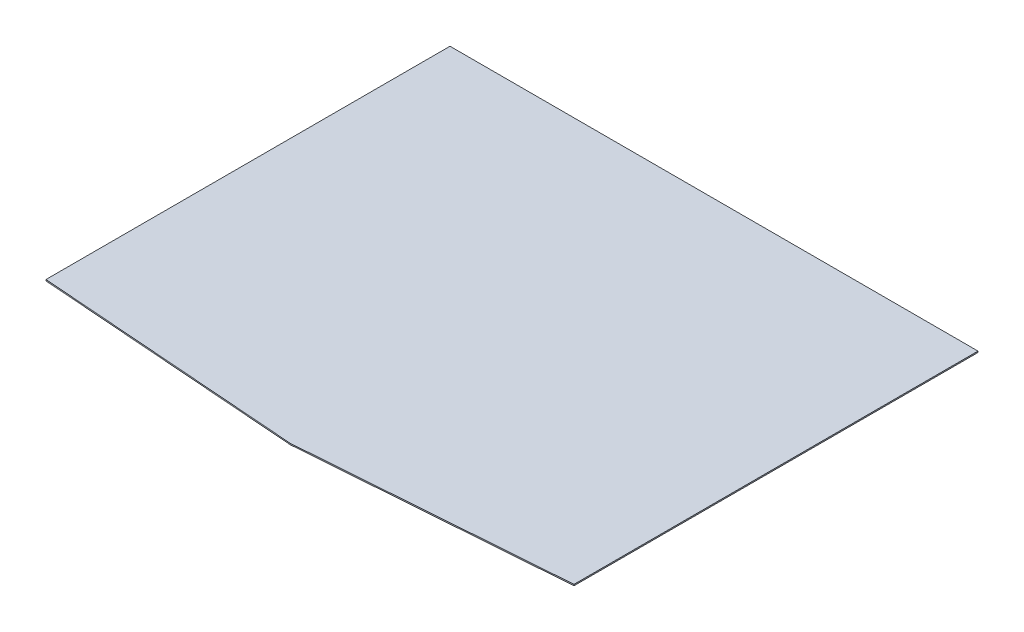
ISO-10303-21;
HEADER;
FILE_DESCRIPTION(('STEP AP214'),'2;1');
FILE_NAME('part.step','',(''),(''),'','','');
FILE_SCHEMA(('AUTOMOTIVE_DESIGN { 1 0 10303 214 1 1 1 1 }'));
ENDSEC;
DATA;
#1=APPLICATION_CONTEXT('core data for automotive mechanical design processes');
#2=APPLICATION_PROTOCOL_DEFINITION('international standard','automotive_design',2000,#1);
#3=PRODUCT_CONTEXT('',#1,'mechanical');
#4=PRODUCT('Part','Part','',(#3));
#5=PRODUCT_RELATED_PRODUCT_CATEGORY('part','',(#4));
#6=PRODUCT_DEFINITION_FORMATION('','',#4);
#7=PRODUCT_DEFINITION_CONTEXT('part definition',#1,'design');
#8=PRODUCT_DEFINITION('design','',#6,#7);
#9=PRODUCT_DEFINITION_SHAPE('','',#8);
#10=(LENGTH_UNIT() NAMED_UNIT(*) SI_UNIT(.MILLI.,.METRE.));
#11=(NAMED_UNIT(*) PLANE_ANGLE_UNIT() SI_UNIT($,.RADIAN.));
#12=(NAMED_UNIT(*) SI_UNIT($,.STERADIAN.) SOLID_ANGLE_UNIT());
#13=UNCERTAINTY_MEASURE_WITH_UNIT(LENGTH_MEASURE(1.E-05),#10,'distance_accuracy_value','');
#14=(GEOMETRIC_REPRESENTATION_CONTEXT(3) GLOBAL_UNCERTAINTY_ASSIGNED_CONTEXT((#13)) GLOBAL_UNIT_ASSIGNED_CONTEXT((#10,
#11,#12)) REPRESENTATION_CONTEXT('',''));
#15=CARTESIAN_POINT('',(0.,0.,0.));
#16=DIRECTION('',(0.,0.,1.));
#17=DIRECTION('',(1.,0.,0.));
#18=AXIS2_PLACEMENT_3D('',#15,#16,#17);
#19=CARTESIAN_POINT('',(0.,-4.7625,0.));
#20=DIRECTION('',(0.0746320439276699,0.,0.99721114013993));
#21=DIRECTION('',(0.99721114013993,0.,-0.0746320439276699));
#22=AXIS2_PLACEMENT_3D('',#19,#20,#21);
#23=PLANE('',#22);
#24=DIRECTION('',(0.99721114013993,0.,-0.0746320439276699));
#25=VECTOR('',#24,1.);
#26=CARTESIAN_POINT('',(0.,0.,0.));
#27=LINE('',#26,#25);
#28=CARTESIAN_POINT('',(0.,0.,0.));
#29=VERTEX_POINT('',#28);
#30=CARTESIAN_POINT('',(996.95,0.,-74.6125));
#31=VERTEX_POINT('',#30);
#32=EDGE_CURVE('E114',#29,#31,#27,.T.);
#33=ORIENTED_EDGE('',*,*,#32,.F.);
#34=DIRECTION('',(0.,1.,0.));
#35=VECTOR('',#34,1.);
#36=CARTESIAN_POINT('',(0.,-4.7625,0.));
#37=LINE('',#36,#35);
#38=CARTESIAN_POINT('',(0.,-4.7625,0.));
#39=VERTEX_POINT('',#38);
#40=EDGE_CURVE('E11',#39,#29,#37,.T.);
#41=ORIENTED_EDGE('',*,*,#40,.F.);
#42=DIRECTION('',(0.99721114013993,0.,-0.0746320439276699));
#43=VECTOR('',#42,1.);
#44=CARTESIAN_POINT('',(0.,-4.7625,0.));
#45=LINE('',#44,#43);
#46=CARTESIAN_POINT('',(996.95,-4.7625,-74.6125));
#47=VERTEX_POINT('',#46);
#48=EDGE_CURVE('E109',#39,#47,#45,.T.);
#49=ORIENTED_EDGE('',*,*,#48,.T.);
#50=DIRECTION('',(0.,1.,0.));
#51=VECTOR('',#50,1.);
#52=CARTESIAN_POINT('',(996.95,-4.7625,-74.6125));
#53=LINE('',#52,#51);
#54=EDGE_CURVE('E40',#47,#31,#53,.T.);
#55=ORIENTED_EDGE('',*,*,#54,.T.);
#56=EDGE_LOOP('',(#33,#41,#49,#55));
#57=FACE_BOUND('',#56,.T.);
#58=ADVANCED_FACE('F37',(#57),#23,.T.);
#59=CARTESIAN_POINT('',(0.,-4.7625,0.));
#60=DIRECTION('',(-0.0746320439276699,0.,0.99721114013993));
#61=DIRECTION('',(0.99721114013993,0.,0.0746320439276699));
#62=AXIS2_PLACEMENT_3D('',#59,#60,#61);
#63=PLANE('',#62);
#64=DIRECTION('',(0.99721114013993,0.,0.0746320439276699));
#65=VECTOR('',#64,1.);
#66=CARTESIAN_POINT('',(0.,0.,0.));
#67=LINE('',#66,#65);
#68=CARTESIAN_POINT('',(-996.95,0.,-74.6125));
#69=VERTEX_POINT('',#68);
#70=EDGE_CURVE('E123',#69,#29,#67,.T.);
#71=ORIENTED_EDGE('',*,*,#70,.F.);
#72=DIRECTION('',(0.,1.,0.));
#73=VECTOR('',#72,1.);
#74=CARTESIAN_POINT('',(-996.95,-4.7625,-74.6125));
#75=LINE('',#74,#73);
#76=CARTESIAN_POINT('',(-996.95,-4.7625,-74.6125));
#77=VERTEX_POINT('',#76);
#78=EDGE_CURVE('E46',#77,#69,#75,.T.);
#79=ORIENTED_EDGE('',*,*,#78,.F.);
#80=DIRECTION('',(0.99721114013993,0.,0.0746320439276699));
#81=VECTOR('',#80,1.);
#82=CARTESIAN_POINT('',(0.,-4.7625,0.));
#83=LINE('',#82,#81);
#84=EDGE_CURVE('E104',#77,#39,#83,.T.);
#85=ORIENTED_EDGE('',*,*,#84,.T.);
#86=ORIENTED_EDGE('',*,*,#40,.T.);
#87=EDGE_LOOP('',(#71,#79,#85,#86));
#88=FACE_BOUND('',#87,.T.);
#89=ADVANCED_FACE('F129',(#88),#63,.T.);
#90=CARTESIAN_POINT('',(-996.95,-4.7625,-1600.2));
#91=DIRECTION('',(-1.,0.,0.));
#92=DIRECTION('',(0.,0.,1.));
#93=AXIS2_PLACEMENT_3D('',#90,#91,#92);
#94=PLANE('',#93);
#95=DIRECTION('',(0.,0.,1.));
#96=VECTOR('',#95,1.);
#97=CARTESIAN_POINT('',(-996.95,0.,-1600.2));
#98=LINE('',#97,#96);
#99=CARTESIAN_POINT('',(-996.95,0.,-1600.2));
#100=VERTEX_POINT('',#99);
#101=EDGE_CURVE('E93',#100,#69,#98,.T.);
#102=ORIENTED_EDGE('',*,*,#101,.F.);
#103=DIRECTION('',(0.,1.,0.));
#104=VECTOR('',#103,1.);
#105=CARTESIAN_POINT('',(-996.95,-4.7625,-1600.2));
#106=LINE('',#105,#104);
#107=CARTESIAN_POINT('',(-996.95,-4.7625,-1600.2));
#108=VERTEX_POINT('',#107);
#109=EDGE_CURVE('E88',#108,#100,#106,.T.);
#110=ORIENTED_EDGE('',*,*,#109,.F.);
#111=DIRECTION('',(0.,0.,1.));
#112=VECTOR('',#111,1.);
#113=CARTESIAN_POINT('',(-996.95,-4.7625,-1600.2));
#114=LINE('',#113,#112);
#115=EDGE_CURVE('E91',#108,#77,#114,.T.);
#116=ORIENTED_EDGE('',*,*,#115,.T.);
#117=ORIENTED_EDGE('',*,*,#78,.T.);
#118=EDGE_LOOP('',(#102,#110,#116,#117));
#119=FACE_BOUND('',#118,.T.);
#120=ADVANCED_FACE('F90',(#119),#94,.T.);
#121=CARTESIAN_POINT('',(996.95,-4.7625,-1600.2));
#122=DIRECTION('',(0.,0.,-1.));
#123=DIRECTION('',(-1.,0.,0.));
#124=AXIS2_PLACEMENT_3D('',#121,#122,#123);
#125=PLANE('',#124);
#126=DIRECTION('',(-1.,0.,0.));
#127=VECTOR('',#126,1.);
#128=CARTESIAN_POINT('',(996.95,0.,-1600.2));
#129=LINE('',#128,#127);
#130=CARTESIAN_POINT('',(996.95,0.,-1600.2));
#131=VERTEX_POINT('',#130);
#132=EDGE_CURVE('E120',#131,#100,#129,.T.);
#133=ORIENTED_EDGE('',*,*,#132,.F.);
#134=DIRECTION('',(0.,1.,0.));
#135=VECTOR('',#134,1.);
#136=CARTESIAN_POINT('',(996.95,-4.7625,-1600.2));
#137=LINE('',#136,#135);
#138=CARTESIAN_POINT('',(996.95,-4.7625,-1600.2));
#139=VERTEX_POINT('',#138);
#140=EDGE_CURVE('E98',#139,#131,#137,.T.);
#141=ORIENTED_EDGE('',*,*,#140,.F.);
#142=DIRECTION('',(-1.,0.,0.));
#143=VECTOR('',#142,1.);
#144=CARTESIAN_POINT('',(996.95,-4.7625,-1600.2));
#145=LINE('',#144,#143);
#146=EDGE_CURVE('E103',#139,#108,#145,.T.);
#147=ORIENTED_EDGE('',*,*,#146,.T.);
#148=ORIENTED_EDGE('',*,*,#109,.T.);
#149=EDGE_LOOP('',(#133,#141,#147,#148));
#150=FACE_BOUND('',#149,.T.);
#151=ADVANCED_FACE('F106',(#150),#125,.T.);
#152=CARTESIAN_POINT('',(996.95,-4.7625,-74.6125));
#153=DIRECTION('',(1.,0.,0.));
#154=DIRECTION('',(0.,0.,-1.));
#155=AXIS2_PLACEMENT_3D('',#152,#153,#154);
#156=PLANE('',#155);
#157=DIRECTION('',(0.,0.,-1.));
#158=VECTOR('',#157,1.);
#159=CARTESIAN_POINT('',(996.95,0.,-74.6125));
#160=LINE('',#159,#158);
#161=EDGE_CURVE('E117',#31,#131,#160,.T.);
#162=ORIENTED_EDGE('',*,*,#161,.F.);
#163=ORIENTED_EDGE('',*,*,#54,.F.);
#164=DIRECTION('',(0.,0.,-1.));
#165=VECTOR('',#164,1.);
#166=CARTESIAN_POINT('',(996.95,-4.7625,-74.6125));
#167=LINE('',#166,#165);
#168=EDGE_CURVE('E107',#47,#139,#167,.T.);
#169=ORIENTED_EDGE('',*,*,#168,.T.);
#170=ORIENTED_EDGE('',*,*,#140,.T.);
#171=EDGE_LOOP('',(#162,#163,#169,#170));
#172=FACE_BOUND('',#171,.T.);
#173=ADVANCED_FACE('F126',(#172),#156,.T.);
#174=CARTESIAN_POINT('',(996.95,-4.7625,-74.6125));
#175=DIRECTION('',(0.,1.,0.));
#176=DIRECTION('',(0.,0.,1.));
#177=AXIS2_PLACEMENT_3D('',#174,#175,#176);
#178=PLANE('',#177);
#179=ORIENTED_EDGE('',*,*,#48,.F.);
#180=ORIENTED_EDGE('',*,*,#84,.F.);
#181=ORIENTED_EDGE('',*,*,#115,.F.);
#182=ORIENTED_EDGE('',*,*,#146,.F.);
#183=ORIENTED_EDGE('',*,*,#168,.F.);
#184=EDGE_LOOP('',(#179,#180,#181,#182,#183));
#185=FACE_BOUND('',#184,.T.);
#186=ADVANCED_FACE('F102',(#185),#178,.F.);
#187=CARTESIAN_POINT('',(996.95,0.,-74.6125));
#188=DIRECTION('',(0.,1.,0.));
#189=DIRECTION('',(0.,0.,1.));
#190=AXIS2_PLACEMENT_3D('',#187,#188,#189);
#191=PLANE('',#190);
#192=ORIENTED_EDGE('',*,*,#32,.T.);
#193=ORIENTED_EDGE('',*,*,#161,.T.);
#194=ORIENTED_EDGE('',*,*,#132,.T.);
#195=ORIENTED_EDGE('',*,*,#101,.T.);
#196=ORIENTED_EDGE('',*,*,#70,.T.);
#197=EDGE_LOOP('',(#192,#193,#194,#195,#196));
#198=FACE_BOUND('',#197,.T.);
#199=ADVANCED_FACE('F128',(#198),#191,.T.);
#200=CLOSED_SHELL('',(#58,#89,#120,#151,#173,#186,#199));
#201=MANIFOLD_SOLID_BREP('B2',#200);
#202=ADVANCED_BREP_SHAPE_REPRESENTATION('',(#18,#201),#14);
#203=SHAPE_DEFINITION_REPRESENTATION(#9,#202);
ENDSEC;
END-ISO-10303-21;
